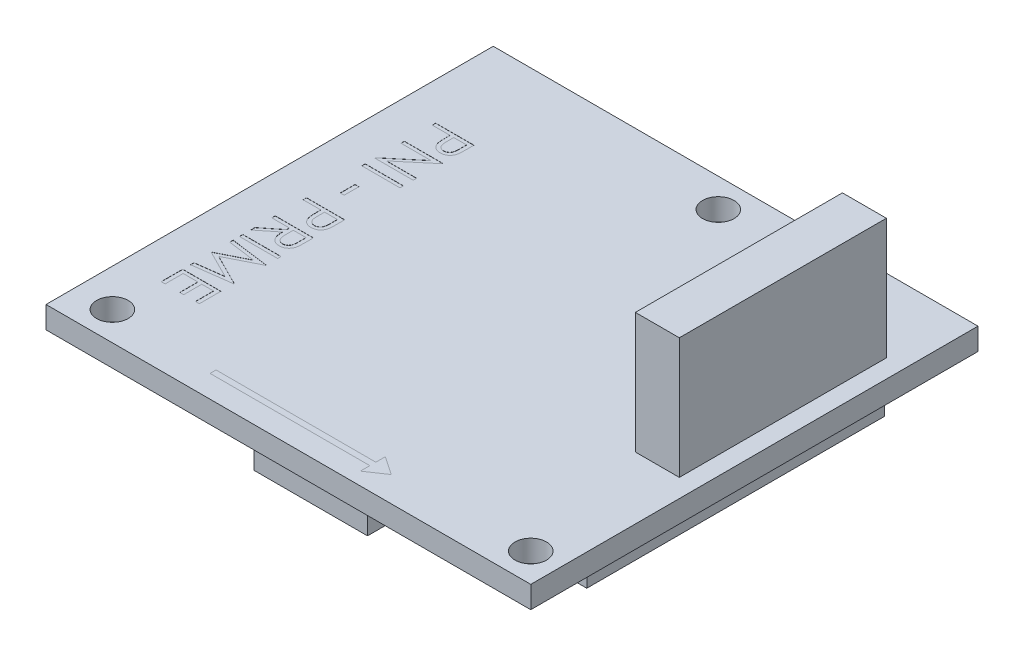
from build123d import *

# Parameters (mm, degrees)
SKETCH1_W           = 33.6
SKETCH1_H           = 31
SKETCH1_R           = 1.0922
BOSS_EXTRUDE1_DEPTH = 1.524
SKETCH2_W           = 3.048
SKETCH2_H           = 14.351
BOSS_EXTRUDE2_DEPTH = 8.382
BOSS_EXTRUDE3_DEPTH = 1.9
CUT_EXTRUDE1_DEPTH  = 1.04
SKETCH7_W           = 2.645833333
SKETCH7_H           = 0.237446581
SKETCH7_W_2         = 0.271367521
SKETCH7_H_2         = 1.017628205
CUT_EXTRUDE2_DEPTH  = 0.01


with BuildPart() as part:
    # Sketch1 → Boss-Extrude1 (new body)
    with BuildSketch(Plane(origin=(0, 0, 0), x_dir=(1, 0, 0), z_dir=(0, 1, 0))):
        Rectangle(SKETCH1_W, SKETCH1_H)
        with Locations(Location((0.8, 13.5, 0), (0, 0, 90))):
            Circle(SKETCH1_R, mode=Mode.SUBTRACT)
        with Locations(Location((14.8, -13.5, 0), (0, 0, 90))):
            Circle(SKETCH1_R, mode=Mode.SUBTRACT)
        with Locations(Location((-14.2, -13.5, 0), (0, 0, 90))):
            Circle(SKETCH1_R, mode=Mode.SUBTRACT)
    extrude(amount=BOSS_EXTRUDE1_DEPTH)

    # Sketch2 → Boss-Extrude2 (add)
    with BuildSketch(Plane(origin=(0, 1.524, 0), x_dir=(1, 0, 0), z_dir=(0, 1, 0))):
        with Locations((14.006, 3.2445)):
            Rectangle(SKETCH2_W, SKETCH2_H)
    extrude(amount=BOSS_EXTRUDE2_DEPTH)

    # Sketch3 → Boss-Extrude3 (add)
    with BuildSketch(Plane.XZ):
        Polygon((15.553080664, -10.281568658), (2.450522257, -10.281568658), (2.450522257, -9.88915281), (-3.237807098, -9.88915281), (-3.237807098, -10.546462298), (-15.542157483, -10.546462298), (-15.542157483, 7.313649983), (-3.058092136, 7.313649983), (-3.058092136, 14.823735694), (4.808676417, 14.823735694), (4.808676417, 10.369691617), (15.553080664, 10.369691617), align=None)
    extrude(amount=BOSS_EXTRUDE3_DEPTH)

    # Sketch5 → Cut-Extrude1 (cut)
    with BuildSketch(Plane.XZ.offset(1.9)):
        Polygon((12.471830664, -7.200318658), (12.471830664, 7.288441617), (1.727426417, 7.288441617), (1.727426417, 11.742485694), (0.023157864, 11.742485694), (0.023157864, 4.232399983), (-12.460907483, 4.232399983), (-12.460907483, -7.465212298), (-6.319057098, -7.465212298), (-6.319057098, -6.80790281), (5.531772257, -6.80790281), (5.531772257, -7.200318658), align=None)
    extrude(amount=-CUT_EXTRUDE1_DEPTH, mode=Mode.SUBTRACT)

    # Sketch7 → Cut-Extrude2 (cut)
    # profile 1 of 9: a face of its own
    with BuildSketch(Plane(origin=(0, 1.524, 0), x_dir=(1, 0, 0), z_dir=(0, 1, 0))):
        Polygon((-11.531150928, -8.646606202), (-11.531150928, -10.139127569), (-11.80251845, -10.139127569), (-11.80251845, -8.884052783), (-12.616621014, -8.884052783), (-12.616621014, -10.139127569), (-12.887988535, -10.139127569), (-12.887988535, -8.884052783), (-13.90561674, -8.884052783), (-13.90561674, -10.139127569), (-14.176984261, -10.139127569), (-14.176984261, -8.646606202), align=None)
    # profile 2 of 9: a face of its own
    with BuildSketch(Plane(origin=(0, 1.524, 0), x_dir=(1, 0, 0), z_dir=(0, 1, 0))):
        Polygon((-14.176984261, -5.152749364), (-11.531150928, -5.502029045), (-11.531150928, -5.535949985), (-13.702091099, -6.628310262), (-11.531150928, -7.718020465), (-11.531150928, -7.752471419), (-14.176984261, -8.103871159), (-14.176984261, -7.865364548), (-12.273171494, -7.612017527), (-14.176984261, -6.656931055), (-14.176984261, -6.603399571), (-12.268931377, -5.644602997), (-14.176984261, -5.391785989), align=None)
    # profile 3 of 9: a face of its own
    with BuildSketch(Plane(origin=(0, 1.524, 0), x_dir=(1, 0, 0), z_dir=(0, 1, 0))):
        with Locations((-12.854067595, -4.593053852)):
            Rectangle(SKETCH7_W, SKETCH7_H)
    # profile 4 of 9: a face of its own
    with BuildSketch(Plane(origin=(0, 1.524, 0), x_dir=(1, 0, 0), z_dir=(0, 1, 0))):
        with BuildLine():
            Line((-11.531150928, -2.235548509), (-11.531150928, -2.765033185))
            add(Edge.make_bspline(
                [(-11.531150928, -2.765033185), (-11.531268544, -2.800367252), (-11.531494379, -2.868212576), (-11.532753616, -2.965407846), (-11.536362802, -3.053723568), (-11.539468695, -3.133113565), (-11.545132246, -3.203576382), (-11.550545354, -3.265328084), (-11.557631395, -3.31808426), (-11.564212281, -3.350020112), (-11.567191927, -3.3644798)],
                knots=[0, 0, 0, 0, 1.410062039, 2.707475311, 3.878576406, 4.937260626, 5.877586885, 6.699081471, 7.410979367, 8, 8, 8, 8], degree=3))
            add(Edge.make_bspline(
                [(-11.567191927, -3.3644798), (-11.571974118, -3.383837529), (-11.581436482, -3.422140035), (-11.601446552, -3.477281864), (-11.62456449, -3.529849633), (-11.65192812, -3.579646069), (-11.683060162, -3.626675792), (-11.718142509, -3.670868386), (-11.757353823, -3.711971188), (-11.79969281, -3.750300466), (-11.845528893, -3.785044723), (-11.894194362, -3.815111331), (-11.945384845, -3.840857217), (-11.999278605, -3.861410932), (-12.055420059, -3.877945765), (-12.114299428, -3.889608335), (-12.175653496, -3.896601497), (-12.217501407, -3.897313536), (-12.23872054, -3.897674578)],
                knots=[0, 0, 0, 0, 1.02737288, 2.032829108, 3.019628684, 3.985738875, 4.958353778, 5.924249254, 6.890702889, 7.883913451, 8.865824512, 9.85161466, 10.829249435, 11.81541824, 12.821369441, 13.843154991, 14.906364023, 16, 16, 16, 16], degree=3))
            add(Edge.make_bspline(
                [(-12.23872054, -3.897674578), (-12.273974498, -3.896564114), (-12.342764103, -3.894397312), (-12.442595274, -3.874194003), (-12.535722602, -3.841102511), (-12.622016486, -3.795495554), (-12.699840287, -3.73744376), (-12.767964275, -3.667678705), (-12.825498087, -3.586556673), (-12.864971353, -3.510682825), (-12.890370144, -3.443628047), (-12.908330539, -3.388262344), (-12.921973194, -3.327821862), (-12.934372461, -3.263173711), (-12.943834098, -3.193818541), (-12.950553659, -3.119896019), (-12.954874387, -3.041221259), (-12.955505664, -2.987291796), (-12.955830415, -2.959548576)],
                knots=[0, 0, 0, 0, 1.260402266, 2.459371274, 3.627181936, 4.786749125, 5.93865593, 7.087644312, 8.261344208, 9.485713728, 10.136162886, 10.825977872, 11.566646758, 12.35154167, 13.181268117, 14.0701832, 15.007234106, 16, 16, 16, 16], degree=3))
            Line((-12.955830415, -2.959548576), (-14.176984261, -3.931595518))
            Line((-14.176984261, -3.931595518), (-14.176984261, -3.63796738))
            Line((-14.176984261, -3.63796738), (-12.955830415, -2.665920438))
            Line((-12.955830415, -2.665920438), (-12.955830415, -2.472995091))
            Line((-12.955830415, -2.472995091), (-14.176984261, -2.472995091))
            Line((-14.176984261, -2.472995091), (-14.176984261, -2.235548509))
            Line((-14.176984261, -2.235548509), (-11.531150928, -2.235548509))
        make_face()
        with BuildLine():
            Line((-11.80251845, -2.472995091), (-12.684462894, -2.472995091))
            Line((-12.684462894, -2.472995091), (-12.688172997, -2.957428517))
            add(Edge.make_bspline(
                [(-12.688172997, -2.957428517), (-12.688183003, -2.980046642), (-12.688202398, -3.023887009), (-12.685183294, -3.087311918), (-12.681748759, -3.146366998), (-12.676495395, -3.200826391), (-12.669724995, -3.250714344), (-12.661256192, -3.296006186), (-12.651389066, -3.336774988), (-12.636119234, -3.384325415), (-12.611913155, -3.437406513), (-12.576755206, -3.495165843), (-12.532248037, -3.544185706), (-12.482163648, -3.586450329), (-12.425964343, -3.619004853), (-12.366144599, -3.642698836), (-12.303220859, -3.65756813), (-12.260001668, -3.659335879), (-12.238190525, -3.660227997)],
                knots=[0, 0, 0, 0, 1.14660753, 2.222451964, 3.218720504, 4.145691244, 4.995719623, 5.770487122, 6.480909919, 7.121111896, 8.299844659, 9.430703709, 10.534634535, 11.641396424, 12.741395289, 13.810956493, 14.895269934, 16, 16, 16, 16], degree=3))
            add(Edge.make_bspline(
                [(-12.238190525, -3.660227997), (-12.216907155, -3.659333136), (-12.174731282, -3.657559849), (-12.113156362, -3.642670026), (-12.054625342, -3.618625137), (-12.000253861, -3.584908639), (-11.95048801, -3.544167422), (-11.908495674, -3.495781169), (-11.87332954, -3.442186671), (-11.851021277, -3.392059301), (-11.837316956, -3.347285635), (-11.827685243, -3.308405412), (-11.819881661, -3.264307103), (-11.813814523, -3.215096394), (-11.808354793, -3.160862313), (-11.804814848, -3.101456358), (-11.802675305, -3.036947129), (-11.802571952, -2.992234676), (-11.80251845, -2.969088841)],
                knots=[0, 0, 0, 0, 1.100801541, 2.181386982, 3.260112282, 4.364594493, 5.481957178, 6.577424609, 7.668452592, 8.790448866, 9.403819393, 10.091598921, 10.863153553, 11.720938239, 12.658472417, 13.685008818, 14.801622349, 16, 16, 16, 16], degree=3))
            Line((-11.80251845, -2.969088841), (-11.80251845, -2.472995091))
        make_face(mode=Mode.SUBTRACT)
    # profile 5 of 9: a face of its own
    with BuildSketch(Plane(origin=(0, 1.524, 0), x_dir=(1, 0, 0), z_dir=(0, 1, 0))):
        with BuildLine():
            Line((-11.531150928, -0.064608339), (-11.531150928, -0.58349272))
            add(Edge.make_bspline(
                [(-11.531150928, -0.58349272), (-11.531190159, -0.619181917), (-11.531265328, -0.687564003), (-11.533544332, -0.785622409), (-11.536588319, -0.874680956), (-11.540807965, -0.954547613), (-11.545794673, -1.025468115), (-11.552788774, -1.08712155), (-11.560091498, -1.139992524), (-11.567516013, -1.171671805), (-11.57090203, -1.186119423)],
                knots=[0, 0, 0, 0, 1.415646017, 2.712440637, 3.8905458, 4.950247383, 5.884950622, 6.709939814, 7.411656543, 8, 8, 8, 8], degree=3))
            add(Edge.make_bspline(
                [(-11.57090203, -1.186119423), (-11.575907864, -1.204408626), (-11.585801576, -1.240556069), (-11.605618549, -1.292641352), (-11.629112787, -1.342199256), (-11.655900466, -1.389385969), (-11.687077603, -1.433672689), (-11.721657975, -1.475626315), (-11.759622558, -1.515487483), (-11.801707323, -1.551902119), (-11.846360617, -1.585426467), (-11.894576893, -1.614185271), (-11.945306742, -1.638511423), (-11.999069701, -1.658378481), (-12.055539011, -1.673485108), (-12.114879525, -1.684646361), (-12.176887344, -1.691787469), (-12.219266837, -1.69246736), (-12.240840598, -1.692813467)],
                knots=[0, 0, 0, 0, 0.999487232, 1.975422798, 2.933948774, 3.889618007, 4.832992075, 5.786114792, 6.754729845, 7.731954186, 8.717668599, 9.695514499, 10.68728626, 11.680675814, 12.71351902, 13.766008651, 14.862761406, 16, 16, 16, 16], degree=3))
            add(Edge.make_bspline(
                [(-12.240840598, -1.692813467), (-12.262595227, -1.69249489), (-12.305159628, -1.691871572), (-12.367429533, -1.684390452), (-12.426936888, -1.674313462), (-12.483549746, -1.658818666), (-12.536931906, -1.638524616), (-12.587899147, -1.614718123), (-12.635584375, -1.586004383), (-12.680160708, -1.55301097), (-12.721669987, -1.516308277), (-12.759811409, -1.476051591), (-12.794361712, -1.432403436), (-12.825398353, -1.385502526), (-12.852201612, -1.334891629), (-12.876208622, -1.281338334), (-12.896370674, -1.224377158), (-12.906976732, -1.184959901), (-12.912369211, -1.164918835)],
                knots=[0, 0, 0, 0, 1.121902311, 2.195077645, 3.232258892, 4.234102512, 5.217864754, 6.176164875, 7.132989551, 8.084763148, 9.034132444, 9.988522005, 10.94243251, 11.903244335, 12.886203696, 13.894208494, 14.929344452, 16, 16, 16, 16], degree=3))
            add(Edge.make_bspline(
                [(-12.912369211, -1.164918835), (-12.915894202, -1.148342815), (-12.923619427, -1.112015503), (-12.932243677, -1.052187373), (-12.939604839, -0.982529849), (-12.945124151, -0.903138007), (-12.949849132, -0.814083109), (-12.953604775, -0.71531698), (-12.955668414, -0.606645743), (-12.955774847, -0.530845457), (-12.955830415, -0.491270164)],
                knots=[0, 0, 0, 0, 0.601384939, 1.31797006, 2.144135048, 3.087295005, 4.142315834, 5.309527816, 6.595305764, 8, 8, 8, 8], degree=3))
            Line((-12.955830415, -0.491270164), (-12.955830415, -0.30205492))
            Line((-12.955830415, -0.30205492), (-14.176984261, -0.30205492))
            Line((-14.176984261, -0.30205492), (-14.176984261, -0.064608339))
            Line((-14.176984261, -0.064608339), (-11.531150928, -0.064608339))
        make_face()
        with BuildLine():
            Line((-11.80251845, -0.30205492), (-12.684462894, -0.30205492))
            Line((-12.684462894, -0.30205492), (-12.690293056, -0.765287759))
            add(Edge.make_bspline(
                [(-12.690293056, -0.765287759), (-12.6903072, -0.787906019), (-12.690334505, -0.831570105), (-12.687280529, -0.89481711), (-12.683911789, -0.95334521), (-12.678636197, -1.007281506), (-12.671685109, -1.056213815), (-12.664118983, -1.100770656), (-12.653868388, -1.140299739), (-12.639575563, -1.186620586), (-12.61567397, -1.238060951), (-12.580086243, -1.293651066), (-12.535968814, -1.341525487), (-12.485683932, -1.382677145), (-12.429540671, -1.414569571), (-12.36994198, -1.438556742), (-12.306850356, -1.452529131), (-12.263697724, -1.454414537), (-12.241900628, -1.455366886)],
                knots=[0, 0, 0, 0, 1.160368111, 2.240066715, 3.248291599, 4.168343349, 5.019594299, 5.784185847, 6.485545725, 7.113397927, 8.269509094, 9.383373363, 10.487084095, 11.595623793, 12.704274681, 13.786671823, 14.88201193, 16, 16, 16, 16], degree=3))
            add(Edge.make_bspline(
                [(-12.241900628, -1.455366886), (-12.220630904, -1.454409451), (-12.178349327, -1.45250619), (-12.1163529, -1.438446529), (-12.057386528, -1.414616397), (-12.001934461, -1.382461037), (-11.95185537, -1.342490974), (-11.908733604, -1.295677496), (-11.873596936, -1.242976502), (-11.851074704, -1.193927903), (-11.837300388, -1.150388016), (-11.82766697, -1.1125653), (-11.819974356, -1.069861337), (-11.81374579, -1.022260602), (-11.808413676, -0.970132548), (-11.804795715, -0.91302917), (-11.802677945, -0.851166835), (-11.802572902, -0.808220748), (-11.80251845, -0.785958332)],
                knots=[0, 0, 0, 0, 1.120550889, 2.227516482, 3.330715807, 4.461473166, 5.594337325, 6.694900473, 7.802844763, 8.919519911, 9.52614448, 10.208195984, 10.975273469, 11.811520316, 12.738076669, 13.736566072, 14.826679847, 16, 16, 16, 16], degree=3))
            Line((-11.80251845, -0.785958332), (-11.80251845, -0.30205492))
        make_face(mode=Mode.SUBTRACT)
    # profile 6 of 9: a face of its own
    with BuildSketch(Plane(origin=(0, 1.524, 0), x_dir=(1, 0, 0), z_dir=(0, 1, 0))):
        with Locations((-13.159356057, 1.902806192)):
            Rectangle(SKETCH7_W_2, SKETCH7_H_2)
    # profile 7 of 9: a face of its own
    with BuildSketch(Plane(origin=(0, 1.524, 0), x_dir=(1, 0, 0), z_dir=(0, 1, 0))):
        with Locations((-12.854067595, 3.887181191)):
            Rectangle(SKETCH7_W, SKETCH7_H)
    # profile 8 of 9: a face of its own
    with BuildSketch(Plane(origin=(0, 1.524, 0), x_dir=(1, 0, 0), z_dir=(0, 1, 0))):
        Polygon((-14.176984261, 6.719579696), (-11.531150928, 6.719579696), (-11.531150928, 6.669758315), (-13.613578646, 4.921769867), (-11.531150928, 4.921769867), (-11.531150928, 4.684323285), (-14.176984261, 4.684323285), (-14.176984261, 4.738384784), (-12.099326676, 6.482133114), (-14.176984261, 6.482133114), align=None)
    # profile 9 of 9: a face of its own
    with BuildSketch(Plane(origin=(0, 1.524, 0), x_dir=(1, 0, 0), z_dir=(0, 1, 0))):
        with BuildLine():
            Line((-11.531150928, 8.890519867), (-11.531150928, 8.371635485))
            add(Edge.make_bspline(
                [(-11.531150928, 8.371635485), (-11.531190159, 8.335946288), (-11.531265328, 8.267564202), (-11.533544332, 8.169505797), (-11.536588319, 8.080447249), (-11.540807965, 8.000580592), (-11.545794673, 7.92966009), (-11.552788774, 7.868006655), (-11.560091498, 7.815135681), (-11.567516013, 7.783456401), (-11.57090203, 7.769008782)],
                knots=[0, 0, 0, 0, 1.415646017, 2.712440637, 3.8905458, 4.950247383, 5.884950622, 6.709939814, 7.411656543, 8, 8, 8, 8], degree=3))
            add(Edge.make_bspline(
                [(-11.57090203, 7.769008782), (-11.575907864, 7.75071958), (-11.585801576, 7.714572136), (-11.605618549, 7.662486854), (-11.629112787, 7.612928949), (-11.655900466, 7.565742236), (-11.687077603, 7.521455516), (-11.721657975, 7.47950189), (-11.759622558, 7.439640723), (-11.801707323, 7.403226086), (-11.846360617, 7.369701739), (-11.894576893, 7.340942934), (-11.945306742, 7.316616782), (-11.999069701, 7.296749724), (-12.055539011, 7.281643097), (-12.114879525, 7.270481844), (-12.176887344, 7.263340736), (-12.219266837, 7.262660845), (-12.240840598, 7.262314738)],
                knots=[0, 0, 0, 0, 0.999487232, 1.975422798, 2.933948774, 3.889618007, 4.832992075, 5.786114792, 6.754729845, 7.731954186, 8.717668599, 9.695514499, 10.68728626, 11.680675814, 12.71351902, 13.766008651, 14.862761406, 16, 16, 16, 16], degree=3))
            add(Edge.make_bspline(
                [(-12.240840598, 7.262314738), (-12.262595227, 7.262633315), (-12.305159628, 7.263256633), (-12.367429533, 7.270737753), (-12.426936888, 7.280814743), (-12.483549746, 7.296309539), (-12.536931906, 7.316603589), (-12.587899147, 7.340410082), (-12.635584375, 7.369123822), (-12.680160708, 7.402117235), (-12.721669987, 7.438819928), (-12.759811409, 7.479076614), (-12.794361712, 7.522724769), (-12.825398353, 7.569625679), (-12.852201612, 7.620236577), (-12.876208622, 7.673789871), (-12.896370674, 7.730751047), (-12.906976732, 7.770168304), (-12.912369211, 7.79020937)],
                knots=[0, 0, 0, 0, 1.121902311, 2.195077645, 3.232258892, 4.234102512, 5.217864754, 6.176164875, 7.132989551, 8.084763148, 9.034132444, 9.988522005, 10.94243251, 11.903244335, 12.886203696, 13.894208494, 14.929344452, 16, 16, 16, 16], degree=3))
            add(Edge.make_bspline(
                [(-12.912369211, 7.79020937), (-12.915894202, 7.80678539), (-12.923619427, 7.843112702), (-12.932243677, 7.902940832), (-12.939604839, 7.972598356), (-12.945124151, 8.051990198), (-12.949849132, 8.141045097), (-12.953604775, 8.239811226), (-12.955668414, 8.348482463), (-12.955774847, 8.424282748), (-12.955830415, 8.463858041)],
                knots=[0, 0, 0, 0, 0.601384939, 1.31797006, 2.144135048, 3.087295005, 4.142315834, 5.309527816, 6.595305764, 8, 8, 8, 8], degree=3))
            Line((-12.955830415, 8.463858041), (-12.955830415, 8.653073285))
            Line((-12.955830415, 8.653073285), (-14.176984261, 8.653073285))
            Line((-14.176984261, 8.653073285), (-14.176984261, 8.890519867))
            Line((-14.176984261, 8.890519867), (-11.531150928, 8.890519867))
        make_face()
        with BuildLine():
            Line((-11.80251845, 8.653073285), (-12.684462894, 8.653073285))
            Line((-12.684462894, 8.653073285), (-12.690293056, 8.189840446))
            add(Edge.make_bspline(
                [(-12.690293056, 8.189840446), (-12.6903072, 8.167222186), (-12.690334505, 8.123558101), (-12.687280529, 8.060311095), (-12.683911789, 8.001782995), (-12.678636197, 7.947846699), (-12.671685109, 7.89891439), (-12.664118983, 7.854357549), (-12.653868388, 7.814828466), (-12.639575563, 7.768507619), (-12.61567397, 7.717067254), (-12.580086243, 7.661477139), (-12.535968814, 7.613602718), (-12.485683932, 7.57245106), (-12.429540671, 7.540558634), (-12.36994198, 7.516571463), (-12.306850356, 7.502599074), (-12.263697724, 7.500713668), (-12.241900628, 7.49976132)],
                knots=[0, 0, 0, 0, 1.160368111, 2.240066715, 3.248291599, 4.168343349, 5.019594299, 5.784185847, 6.485545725, 7.113397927, 8.269509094, 9.383373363, 10.487084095, 11.595623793, 12.704274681, 13.786671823, 14.88201193, 16, 16, 16, 16], degree=3))
            add(Edge.make_bspline(
                [(-12.241900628, 7.49976132), (-12.220630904, 7.500718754), (-12.178349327, 7.502622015), (-12.1163529, 7.516681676), (-12.057386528, 7.540511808), (-12.001934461, 7.572667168), (-11.95185537, 7.612637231), (-11.908733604, 7.659450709), (-11.873596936, 7.712151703), (-11.851074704, 7.761200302), (-11.837300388, 7.804740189), (-11.82766697, 7.842562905), (-11.819974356, 7.885266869), (-11.81374579, 7.932867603), (-11.808413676, 7.984995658), (-11.804795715, 8.042099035), (-11.802677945, 8.10396137), (-11.802572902, 8.146907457), (-11.80251845, 8.169169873)],
                knots=[0, 0, 0, 0, 1.120550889, 2.227516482, 3.330715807, 4.461473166, 5.594337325, 6.694900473, 7.802844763, 8.919519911, 9.52614448, 10.208195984, 10.975273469, 11.811520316, 12.738076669, 13.736566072, 14.826679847, 16, 16, 16, 16], degree=3))
            Line((-11.80251845, 8.169169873), (-11.80251845, 8.653073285))
        make_face(mode=Mode.SUBTRACT)
    extrude(amount=-CUT_EXTRUDE2_DEPTH, mode=Mode.SUBTRACT)


solid = part.part
